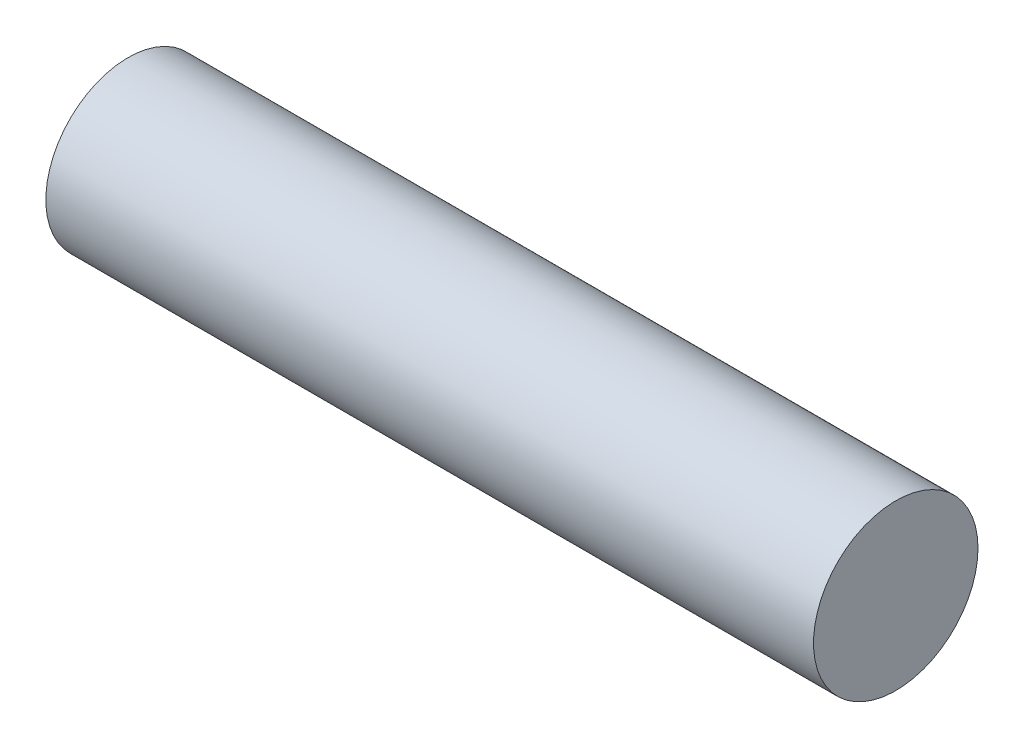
from build123d import *

# Parameters (mm, degrees)
SKETCH1_R           = 15
BOSS_EXTRUDE1_DEPTH = 70


with BuildPart() as part:
    # Sketch1 → Boss-Extrude1 (new, symmetric)
    with BuildSketch(Plane(origin=(0, 0, 0), x_dir=(0, 0, -1), z_dir=(1, 0, 0))):
        Circle(SKETCH1_R)
    extrude(amount=BOSS_EXTRUDE1_DEPTH, both=True)


solid = part.part
